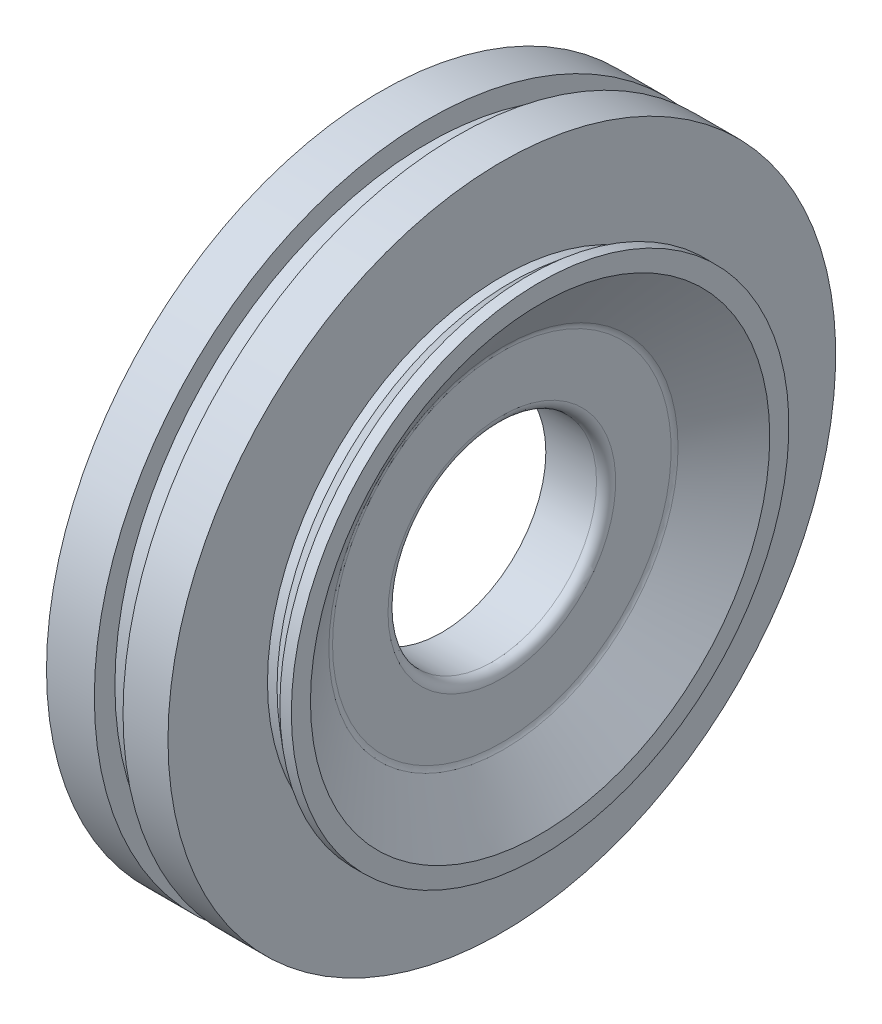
ISO-10303-21;
HEADER;
FILE_DESCRIPTION(('STEP AP214'),'2;1');
FILE_NAME('part.step','',(''),(''),'','','');
FILE_SCHEMA(('AUTOMOTIVE_DESIGN { 1 0 10303 214 1 1 1 1 }'));
ENDSEC;
DATA;
#1=APPLICATION_CONTEXT('core data for automotive mechanical design processes');
#2=APPLICATION_PROTOCOL_DEFINITION('international standard','automotive_design',2000,#1);
#3=PRODUCT_CONTEXT('',#1,'mechanical');
#4=PRODUCT('Part','Part','',(#3));
#5=PRODUCT_RELATED_PRODUCT_CATEGORY('part','',(#4));
#6=PRODUCT_DEFINITION_FORMATION('','',#4);
#7=PRODUCT_DEFINITION_CONTEXT('part definition',#1,'design');
#8=PRODUCT_DEFINITION('design','',#6,#7);
#9=PRODUCT_DEFINITION_SHAPE('','',#8);
#10=(LENGTH_UNIT() NAMED_UNIT(*) SI_UNIT(.MILLI.,.METRE.));
#11=(NAMED_UNIT(*) PLANE_ANGLE_UNIT() SI_UNIT($,.RADIAN.));
#12=(NAMED_UNIT(*) SI_UNIT($,.STERADIAN.) SOLID_ANGLE_UNIT());
#13=UNCERTAINTY_MEASURE_WITH_UNIT(LENGTH_MEASURE(1.E-05),#10,'distance_accuracy_value','');
#14=(GEOMETRIC_REPRESENTATION_CONTEXT(3) GLOBAL_UNCERTAINTY_ASSIGNED_CONTEXT((#13)) GLOBAL_UNIT_ASSIGNED_CONTEXT((#10,
#11,#12)) REPRESENTATION_CONTEXT('',''));
#15=CARTESIAN_POINT('',(0.,0.,0.));
#16=DIRECTION('',(0.,0.,1.));
#17=DIRECTION('',(1.,0.,0.));
#18=AXIS2_PLACEMENT_3D('',#15,#16,#17);
#19=CARTESIAN_POINT('',(0.,0.,0.));
#20=DIRECTION('',(-1.,0.,0.));
#21=DIRECTION('',(0.,0.,1.));
#22=AXIS2_PLACEMENT_3D('',#19,#20,#21);
#23=CYLINDRICAL_SURFACE('',#22,34.9);
#24=CARTESIAN_POINT('',(1.23792887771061,0.,0.));
#25=DIRECTION('',(-1.,0.,0.));
#26=DIRECTION('',(0.,0.,1.));
#27=AXIS2_PLACEMENT_3D('',#24,#25,#26);
#28=CIRCLE('',#27,34.9);
#29=CARTESIAN_POINT('',(1.23792887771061,0.,34.9));
#30=VERTEX_POINT('',#29);
#31=EDGE_CURVE('E49',#30,#30,#28,.T.);
#32=ORIENTED_EDGE('',*,*,#31,.F.);
#33=EDGE_LOOP('',(#32));
#34=FACE_BOUND('',#33,.T.);
#35=CARTESIAN_POINT('',(6.23792887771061,0.,0.));
#36=DIRECTION('',(-1.,0.,0.));
#37=DIRECTION('',(0.,0.,1.));
#38=AXIS2_PLACEMENT_3D('',#35,#36,#37);
#39=CIRCLE('',#38,34.9);
#40=CARTESIAN_POINT('',(6.23792887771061,0.,34.9));
#41=VERTEX_POINT('',#40);
#42=EDGE_CURVE('E112',#41,#41,#39,.T.);
#43=ORIENTED_EDGE('',*,*,#42,.T.);
#44=EDGE_LOOP('',(#43));
#45=FACE_BOUND('',#44,.T.);
#46=ADVANCED_FACE('F29',(#34,#45),#23,.T.);
#47=CARTESIAN_POINT('',(1.23792887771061,27.5660176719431,0.));
#48=DIRECTION('',(1.,0.,0.));
#49=DIRECTION('',(0.,0.,-1.));
#50=AXIS2_PLACEMENT_3D('',#47,#48,#49);
#51=PLANE('',#50);
#52=CARTESIAN_POINT('',(1.23792887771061,0.,0.));
#53=DIRECTION('',(-1.,0.,0.));
#54=DIRECTION('',(0.,0.,1.));
#55=AXIS2_PLACEMENT_3D('',#52,#53,#54);
#56=CIRCLE('',#55,27.5660176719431);
#57=CARTESIAN_POINT('',(1.23792887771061,0.,27.5660176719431));
#58=VERTEX_POINT('',#57);
#59=EDGE_CURVE('E52',#58,#58,#56,.T.);
#60=ORIENTED_EDGE('',*,*,#59,.F.);
#61=EDGE_LOOP('',(#60));
#62=FACE_BOUND('',#61,.T.);
#63=ORIENTED_EDGE('',*,*,#31,.T.);
#64=EDGE_LOOP('',(#63));
#65=FACE_BOUND('',#64,.T.);
#66=ADVANCED_FACE('F183',(#62,#65),#51,.F.);
#67=CARTESIAN_POINT('',(1.73792887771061,0.,0.));
#68=DIRECTION('',(-1.,0.,0.));
#69=DIRECTION('',(0.,0.,1.));
#70=AXIS2_PLACEMENT_3D('',#67,#68,#69);
#71=TOROIDAL_SURFACE('',#70,27.5660176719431,0.5);
#72=CARTESIAN_POINT('',(1.710156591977,0.,0.));
#73=DIRECTION('',(-1.,0.,0.));
#74=DIRECTION('',(0.,0.,1.));
#75=AXIS2_PLACEMENT_3D('',#72,#73,#74);
#76=CIRCLE('',#75,27.0667895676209);
#77=CARTESIAN_POINT('',(1.710156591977,0.,27.0667895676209));
#78=VERTEX_POINT('',#77);
#79=EDGE_CURVE('E55',#78,#78,#76,.T.);
#80=ORIENTED_EDGE('',*,*,#79,.F.);
#81=EDGE_LOOP('',(#80));
#82=FACE_BOUND('',#81,.T.);
#83=ORIENTED_EDGE('',*,*,#59,.T.);
#84=EDGE_LOOP('',(#83));
#85=FACE_BOUND('',#84,.T.);
#86=ADVANCED_FACE('F189',(#82,#85),#71,.T.);
#87=CARTESIAN_POINT('',(1.710156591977,0.,0.));
#88=DIRECTION('',(-1.,0.,0.));
#89=DIRECTION('',(0.,0.,1.));
#90=AXIS2_PLACEMENT_3D('',#87,#88,#89);
#91=CONICAL_SURFACE('',#90,27.0667895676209,0.055573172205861);
#92=CARTESIAN_POINT('',(8.20913066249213,0.,0.));
#93=DIRECTION('',(-1.,0.,0.));
#94=DIRECTION('',(0.,0.,1.));
#95=AXIS2_PLACEMENT_3D('',#92,#93,#94);
#96=CIRCLE('',#95,26.7052486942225);
#97=CARTESIAN_POINT('',(8.20913066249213,0.,26.7052486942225));
#98=VERTEX_POINT('',#97);
#99=EDGE_CURVE('E58',#98,#98,#96,.T.);
#100=ORIENTED_EDGE('',*,*,#99,.F.);
#101=EDGE_LOOP('',(#100));
#102=FACE_BOUND('',#101,.T.);
#103=ORIENTED_EDGE('',*,*,#79,.T.);
#104=EDGE_LOOP('',(#103));
#105=FACE_BOUND('',#104,.T.);
#106=ADVANCED_FACE('F363',(#102,#105),#91,.F.);
#107=CARTESIAN_POINT('',(8.09804151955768,0.,0.));
#108=DIRECTION('',(-1.,0.,0.));
#109=DIRECTION('',(0.,0.,1.));
#110=AXIS2_PLACEMENT_3D('',#107,#108,#109);
#111=TOROIDAL_SURFACE('',#110,24.7083362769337,2.);
#112=CARTESIAN_POINT('',(10.0959925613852,0.,0.));
#113=DIRECTION('',(-1.,0.,0.));
#114=DIRECTION('',(0.,0.,1.));
#115=AXIS2_PLACEMENT_3D('',#112,#113,#114);
#116=CIRCLE('',#115,24.6178286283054);
#117=CARTESIAN_POINT('',(10.0959925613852,0.,24.6178286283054));
#118=VERTEX_POINT('',#117);
#119=EDGE_CURVE('E61',#118,#118,#116,.T.);
#120=ORIENTED_EDGE('',*,*,#119,.F.);
#121=EDGE_LOOP('',(#120));
#122=FACE_BOUND('',#121,.T.);
#123=ORIENTED_EDGE('',*,*,#99,.T.);
#124=EDGE_LOOP('',(#123));
#125=FACE_BOUND('',#124,.T.);
#126=ADVANCED_FACE('F353',(#122,#125),#111,.F.);
#127=CARTESIAN_POINT('',(10.0959925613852,0.,0.));
#128=DIRECTION('',(1.,0.,0.));
#129=DIRECTION('',(0.,0.,-1.));
#130=AXIS2_PLACEMENT_3D('',#127,#128,#129);
#131=CONICAL_SURFACE('',#130,24.6178286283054,1.52552704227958);
#132=CARTESIAN_POINT('',(9.79418985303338,0.,0.));
#133=DIRECTION('',(-1.,0.,0.));
#134=DIRECTION('',(0.,0.,1.));
#135=AXIS2_PLACEMENT_3D('',#132,#133,#134);
#136=CIRCLE('',#135,17.9555515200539);
#137=CARTESIAN_POINT('',(9.79418985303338,0.,17.9555515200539));
#138=VERTEX_POINT('',#137);
#139=EDGE_CURVE('E64',#138,#138,#136,.T.);
#140=ORIENTED_EDGE('',*,*,#139,.F.);
#141=EDGE_LOOP('',(#140));
#142=FACE_BOUND('',#141,.T.);
#143=ORIENTED_EDGE('',*,*,#119,.T.);
#144=EDGE_LOOP('',(#143));
#145=FACE_BOUND('',#144,.T.);
#146=ADVANCED_FACE('F343',(#142,#145),#131,.T.);
#147=CARTESIAN_POINT('',(9.29470209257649,0.,0.));
#148=DIRECTION('',(-1.,0.,0.));
#149=DIRECTION('',(0.,0.,1.));
#150=AXIS2_PLACEMENT_3D('',#147,#148,#149);
#151=TOROIDAL_SURFACE('',#150,17.9781784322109,0.500000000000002);
#152=CARTESIAN_POINT('',(9.3677140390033,0.,0.));
#153=DIRECTION('',(-1.,0.,0.));
#154=DIRECTION('',(0.,0.,1.));
#155=AXIS2_PLACEMENT_3D('',#152,#153,#154);
#156=CIRCLE('',#155,17.4835379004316);
#157=CARTESIAN_POINT('',(9.3677140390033,0.,17.4835379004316));
#158=VERTEX_POINT('',#157);
#159=EDGE_CURVE('E67',#158,#158,#156,.T.);
#160=ORIENTED_EDGE('',*,*,#159,.F.);
#161=EDGE_LOOP('',(#160));
#162=FACE_BOUND('',#161,.T.);
#163=ORIENTED_EDGE('',*,*,#139,.T.);
#164=EDGE_LOOP('',(#163));
#165=FACE_BOUND('',#164,.T.);
#166=ADVANCED_FACE('F333',(#162,#165),#151,.F.);
#167=CARTESIAN_POINT('',(9.3677140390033,0.,0.));
#168=DIRECTION('',(1.,0.,0.));
#169=DIRECTION('',(0.,0.,-1.));
#170=AXIS2_PLACEMENT_3D('',#167,#168,#169);
#171=CONICAL_SURFACE('',#170,17.4835379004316,0.146547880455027);
#172=CARTESIAN_POINT('',(7.2649169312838,0.,0.));
#173=DIRECTION('',(-1.,0.,0.));
#174=DIRECTION('',(0.,0.,1.));
#175=AXIS2_PLACEMENT_3D('',#172,#173,#174);
#176=CIRCLE('',#175,17.1731522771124);
#177=CARTESIAN_POINT('',(7.2649169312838,0.,17.1731522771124));
#178=VERTEX_POINT('',#177);
#179=EDGE_CURVE('E70',#178,#178,#176,.T.);
#180=ORIENTED_EDGE('',*,*,#179,.F.);
#181=EDGE_LOOP('',(#180));
#182=FACE_BOUND('',#181,.T.);
#183=ORIENTED_EDGE('',*,*,#159,.T.);
#184=EDGE_LOOP('',(#183));
#185=FACE_BOUND('',#184,.T.);
#186=ADVANCED_FACE('F323',(#182,#185),#171,.T.);
#187=CARTESIAN_POINT('',(7.33792887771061,0.,0.));
#188=DIRECTION('',(-1.,0.,0.));
#189=DIRECTION('',(0.,0.,1.));
#190=AXIS2_PLACEMENT_3D('',#187,#188,#189);
#191=TOROIDAL_SURFACE('',#190,16.678511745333,0.5);
#192=CARTESIAN_POINT('',(6.83792887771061,0.,0.));
#193=DIRECTION('',(-1.,0.,0.));
#194=DIRECTION('',(0.,0.,1.));
#195=AXIS2_PLACEMENT_3D('',#192,#193,#194);
#196=CIRCLE('',#195,16.678511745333);
#197=CARTESIAN_POINT('',(6.83792887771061,0.,16.678511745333));
#198=VERTEX_POINT('',#197);
#199=EDGE_CURVE('E73',#198,#198,#196,.T.);
#200=ORIENTED_EDGE('',*,*,#199,.F.);
#201=EDGE_LOOP('',(#200));
#202=FACE_BOUND('',#201,.T.);
#203=ORIENTED_EDGE('',*,*,#179,.T.);
#204=EDGE_LOOP('',(#203));
#205=FACE_BOUND('',#204,.T.);
#206=ADVANCED_FACE('F313',(#202,#205),#191,.T.);
#207=CARTESIAN_POINT('',(6.83792887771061,16.678511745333,0.));
#208=DIRECTION('',(1.,0.,0.));
#209=DIRECTION('',(0.,0.,-1.));
#210=AXIS2_PLACEMENT_3D('',#207,#208,#209);
#211=PLANE('',#210);
#212=CARTESIAN_POINT('',(6.83792887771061,0.,0.));
#213=DIRECTION('',(-1.,0.,0.));
#214=DIRECTION('',(0.,0.,1.));
#215=AXIS2_PLACEMENT_3D('',#212,#213,#214);
#216=CIRCLE('',#215,14.5);
#217=CARTESIAN_POINT('',(6.83792887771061,0.,14.5));
#218=VERTEX_POINT('',#217);
#219=EDGE_CURVE('E76',#218,#218,#216,.T.);
#220=ORIENTED_EDGE('',*,*,#219,.F.);
#221=EDGE_LOOP('',(#220));
#222=FACE_BOUND('',#221,.T.);
#223=ORIENTED_EDGE('',*,*,#199,.T.);
#224=EDGE_LOOP('',(#223));
#225=FACE_BOUND('',#224,.T.);
#226=ADVANCED_FACE('F303',(#222,#225),#211,.F.);
#227=CARTESIAN_POINT('',(0.,0.,0.));
#228=DIRECTION('',(-1.,0.,0.));
#229=DIRECTION('',(0.,0.,1.));
#230=AXIS2_PLACEMENT_3D('',#227,#228,#229);
#231=CYLINDRICAL_SURFACE('',#230,14.5);
#232=CARTESIAN_POINT('',(7.63792887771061,0.,0.));
#233=DIRECTION('',(-1.,0.,0.));
#234=DIRECTION('',(0.,0.,1.));
#235=AXIS2_PLACEMENT_3D('',#232,#233,#234);
#236=CIRCLE('',#235,14.5);
#237=CARTESIAN_POINT('',(7.63792887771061,0.,14.5));
#238=VERTEX_POINT('',#237);
#239=EDGE_CURVE('E79',#238,#238,#236,.T.);
#240=ORIENTED_EDGE('',*,*,#239,.F.);
#241=EDGE_LOOP('',(#240));
#242=FACE_BOUND('',#241,.T.);
#243=ORIENTED_EDGE('',*,*,#219,.T.);
#244=EDGE_LOOP('',(#243));
#245=FACE_BOUND('',#244,.T.);
#246=ADVANCED_FACE('F293',(#242,#245),#231,.F.);
#247=CARTESIAN_POINT('',(7.63792887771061,14.5,0.));
#248=DIRECTION('',(1.,0.,0.));
#249=DIRECTION('',(0.,0.,-1.));
#250=AXIS2_PLACEMENT_3D('',#247,#248,#249);
#251=PLANE('',#250);
#252=CARTESIAN_POINT('',(7.63792887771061,0.,0.));
#253=DIRECTION('',(-1.,0.,0.));
#254=DIRECTION('',(0.,0.,1.));
#255=AXIS2_PLACEMENT_3D('',#252,#253,#254);
#256=CIRCLE('',#255,10.9);
#257=CARTESIAN_POINT('',(7.63792887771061,0.,10.9));
#258=VERTEX_POINT('',#257);
#259=EDGE_CURVE('E82',#258,#258,#256,.T.);
#260=ORIENTED_EDGE('',*,*,#259,.F.);
#261=EDGE_LOOP('',(#260));
#262=FACE_BOUND('',#261,.T.);
#263=ORIENTED_EDGE('',*,*,#239,.T.);
#264=EDGE_LOOP('',(#263));
#265=FACE_BOUND('',#264,.T.);
#266=ADVANCED_FACE('F232',(#262,#265),#251,.F.);
#267=CARTESIAN_POINT('',(0.,0.,0.));
#268=DIRECTION('',(-1.,0.,0.));
#269=DIRECTION('',(0.,0.,1.));
#270=AXIS2_PLACEMENT_3D('',#267,#268,#269);
#271=CYLINDRICAL_SURFACE('',#270,10.9);
#272=CARTESIAN_POINT('',(12.9379288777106,0.,0.));
#273=DIRECTION('',(-1.,0.,0.));
#274=DIRECTION('',(0.,0.,1.));
#275=AXIS2_PLACEMENT_3D('',#272,#273,#274);
#276=CIRCLE('',#275,10.9);
#277=CARTESIAN_POINT('',(12.9379288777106,0.,10.9));
#278=VERTEX_POINT('',#277);
#279=EDGE_CURVE('E36',#278,#278,#276,.F.);
#280=ORIENTED_EDGE('',*,*,#279,.T.);
#281=EDGE_LOOP('',(#280));
#282=FACE_BOUND('',#281,.T.);
#283=ORIENTED_EDGE('',*,*,#259,.T.);
#284=EDGE_LOOP('',(#283));
#285=FACE_BOUND('',#284,.T.);
#286=ADVANCED_FACE('F179',(#282,#285),#271,.F.);
#287=CARTESIAN_POINT('',(13.9379288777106,10.9,0.));
#288=DIRECTION('',(-1.,0.,0.));
#289=DIRECTION('',(0.,0.,1.));
#290=AXIS2_PLACEMENT_3D('',#287,#288,#289);
#291=PLANE('',#290);
#292=CARTESIAN_POINT('',(13.9379288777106,0.,0.));
#293=DIRECTION('',(-1.,0.,0.));
#294=DIRECTION('',(0.,0.,1.));
#295=AXIS2_PLACEMENT_3D('',#292,#293,#294);
#296=CIRCLE('',#295,11.9);
#297=CARTESIAN_POINT('',(13.9379288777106,0.,11.9));
#298=VERTEX_POINT('',#297);
#299=EDGE_CURVE('E40',#298,#298,#296,.T.);
#300=ORIENTED_EDGE('',*,*,#299,.T.);
#301=EDGE_LOOP('',(#300));
#302=FACE_BOUND('',#301,.T.);
#303=CARTESIAN_POINT('',(13.9379288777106,0.,0.));
#304=DIRECTION('',(-1.,0.,0.));
#305=DIRECTION('',(0.,0.,1.));
#306=AXIS2_PLACEMENT_3D('',#303,#304,#305);
#307=CIRCLE('',#306,17.6974936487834);
#308=CARTESIAN_POINT('',(13.9379288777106,0.,17.6974936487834));
#309=VERTEX_POINT('',#308);
#310=EDGE_CURVE('E44',#309,#309,#307,.F.);
#311=ORIENTED_EDGE('',*,*,#310,.T.);
#312=EDGE_LOOP('',(#311));
#313=FACE_BOUND('',#312,.T.);
#314=ADVANCED_FACE('F174',(#302,#313),#291,.F.);
#315=CARTESIAN_POINT('',(13.9379288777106,0.,0.));
#316=DIRECTION('',(1.,0.,0.));
#317=DIRECTION('',(0.,0.,-1.));
#318=AXIS2_PLACEMENT_3D('',#315,#316,#317);
#319=CONICAL_SURFACE('',#318,18.,0.983287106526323);
#320=CARTESIAN_POINT('',(14.105605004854,0.,0.));
#321=DIRECTION('',(1.,0.,0.));
#322=DIRECTION('',(0.,0.,-1.));
#323=AXIS2_PLACEMENT_3D('',#320,#321,#322);
#324=CIRCLE('',#323,18.2517832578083);
#325=CARTESIAN_POINT('',(14.105605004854,0.,-18.2517832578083));
#326=VERTEX_POINT('',#325);
#327=EDGE_CURVE('E10',#326,#326,#324,.F.);
#328=ORIENTED_EDGE('',*,*,#327,.T.);
#329=EDGE_LOOP('',(#328));
#330=FACE_BOUND('',#329,.T.);
#331=CARTESIAN_POINT('',(17.9379288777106,0.,0.));
#332=DIRECTION('',(-1.,0.,0.));
#333=DIRECTION('',(0.,0.,1.));
#334=AXIS2_PLACEMENT_3D('',#331,#332,#333);
#335=CIRCLE('',#334,24.0064187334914);
#336=CARTESIAN_POINT('',(17.9379288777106,0.,24.0064187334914));
#337=VERTEX_POINT('',#336);
#338=EDGE_CURVE('E85',#337,#337,#335,.T.);
#339=ORIENTED_EDGE('',*,*,#338,.F.);
#340=EDGE_LOOP('',(#339));
#341=FACE_BOUND('',#340,.T.);
#342=ADVANCED_FACE('F169',(#330,#341),#319,.F.);
#343=CARTESIAN_POINT('',(17.9379288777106,26.0064187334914,0.));
#344=DIRECTION('',(-1.,0.,0.));
#345=DIRECTION('',(0.,0.,1.));
#346=AXIS2_PLACEMENT_3D('',#343,#344,#345);
#347=PLANE('',#346);
#348=CARTESIAN_POINT('',(17.9379288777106,0.,0.));
#349=DIRECTION('',(-1.,0.,0.));
#350=DIRECTION('',(0.,0.,1.));
#351=AXIS2_PLACEMENT_3D('',#348,#349,#350);
#352=CIRCLE('',#351,26.0064187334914);
#353=CARTESIAN_POINT('',(17.9379288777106,0.,26.0064187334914));
#354=VERTEX_POINT('',#353);
#355=EDGE_CURVE('E88',#354,#354,#352,.T.);
#356=ORIENTED_EDGE('',*,*,#355,.F.);
#357=EDGE_LOOP('',(#356));
#358=FACE_BOUND('',#357,.T.);
#359=ORIENTED_EDGE('',*,*,#338,.T.);
#360=EDGE_LOOP('',(#359));
#361=FACE_BOUND('',#360,.T.);
#362=ADVANCED_FACE('F163',(#358,#361),#347,.F.);
#363=CARTESIAN_POINT('',(0.,0.,0.));
#364=DIRECTION('',(-1.,0.,0.));
#365=DIRECTION('',(0.,0.,1.));
#366=AXIS2_PLACEMENT_3D('',#363,#364,#365);
#367=CYLINDRICAL_SURFACE('',#366,26.0064187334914);
#368=CARTESIAN_POINT('',(16.7379288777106,0.,0.));
#369=DIRECTION('',(-1.,0.,0.));
#370=DIRECTION('',(0.,0.,1.));
#371=AXIS2_PLACEMENT_3D('',#368,#369,#370);
#372=CIRCLE('',#371,26.0064187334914);
#373=CARTESIAN_POINT('',(16.7379288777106,0.,26.0064187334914));
#374=VERTEX_POINT('',#373);
#375=EDGE_CURVE('E91',#374,#374,#372,.T.);
#376=ORIENTED_EDGE('',*,*,#375,.F.);
#377=EDGE_LOOP('',(#376));
#378=FACE_BOUND('',#377,.T.);
#379=ORIENTED_EDGE('',*,*,#355,.T.);
#380=EDGE_LOOP('',(#379));
#381=FACE_BOUND('',#380,.T.);
#382=ADVANCED_FACE('F157',(#378,#381),#367,.T.);
#383=CARTESIAN_POINT('',(16.7379288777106,0.,0.));
#384=DIRECTION('',(1.,0.,0.));
#385=DIRECTION('',(0.,0.,-1.));
#386=AXIS2_PLACEMENT_3D('',#383,#384,#385);
#387=CONICAL_SURFACE('',#386,26.0064187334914,0.696839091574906);
#388=CARTESIAN_POINT('',(14.9379288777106,0.,0.));
#389=DIRECTION('',(-1.,0.,0.));
#390=DIRECTION('',(0.,0.,1.));
#391=AXIS2_PLACEMENT_3D('',#388,#389,#390);
#392=CIRCLE('',#391,24.5);
#393=CARTESIAN_POINT('',(14.9379288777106,0.,24.5));
#394=VERTEX_POINT('',#393);
#395=EDGE_CURVE('E94',#394,#394,#392,.T.);
#396=ORIENTED_EDGE('',*,*,#395,.F.);
#397=EDGE_LOOP('',(#396));
#398=FACE_BOUND('',#397,.T.);
#399=ORIENTED_EDGE('',*,*,#375,.T.);
#400=EDGE_LOOP('',(#399));
#401=FACE_BOUND('',#400,.T.);
#402=ADVANCED_FACE('F151',(#398,#401),#387,.T.);
#403=CARTESIAN_POINT('',(0.,0.,0.));
#404=DIRECTION('',(-1.,0.,0.));
#405=DIRECTION('',(0.,0.,1.));
#406=AXIS2_PLACEMENT_3D('',#403,#404,#405);
#407=CYLINDRICAL_SURFACE('',#406,24.5);
#408=CARTESIAN_POINT('',(13.9379288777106,0.,0.));
#409=DIRECTION('',(-1.,0.,0.));
#410=DIRECTION('',(0.,0.,1.));
#411=AXIS2_PLACEMENT_3D('',#408,#409,#410);
#412=CIRCLE('',#411,24.5);
#413=CARTESIAN_POINT('',(13.9379288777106,0.,24.5));
#414=VERTEX_POINT('',#413);
#415=EDGE_CURVE('E97',#414,#414,#412,.T.);
#416=ORIENTED_EDGE('',*,*,#415,.F.);
#417=EDGE_LOOP('',(#416));
#418=FACE_BOUND('',#417,.T.);
#419=ORIENTED_EDGE('',*,*,#395,.T.);
#420=EDGE_LOOP('',(#419));
#421=FACE_BOUND('',#420,.T.);
#422=ADVANCED_FACE('F145',(#418,#421),#407,.T.);
#423=CARTESIAN_POINT('',(13.9379288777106,34.9,0.));
#424=DIRECTION('',(-1.,0.,0.));
#425=DIRECTION('',(0.,0.,1.));
#426=AXIS2_PLACEMENT_3D('',#423,#424,#425);
#427=PLANE('',#426);
#428=CARTESIAN_POINT('',(13.9379288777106,0.,0.));
#429=DIRECTION('',(-1.,0.,0.));
#430=DIRECTION('',(0.,0.,1.));
#431=AXIS2_PLACEMENT_3D('',#428,#429,#430);
#432=CIRCLE('',#431,34.9);
#433=CARTESIAN_POINT('',(13.9379288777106,0.,34.9));
#434=VERTEX_POINT('',#433);
#435=EDGE_CURVE('E100',#434,#434,#432,.T.);
#436=ORIENTED_EDGE('',*,*,#435,.F.);
#437=EDGE_LOOP('',(#436));
#438=FACE_BOUND('',#437,.T.);
#439=ORIENTED_EDGE('',*,*,#415,.T.);
#440=EDGE_LOOP('',(#439));
#441=FACE_BOUND('',#440,.T.);
#442=ADVANCED_FACE('F139',(#438,#441),#427,.F.);
#443=CARTESIAN_POINT('',(0.,0.,0.));
#444=DIRECTION('',(-1.,0.,0.));
#445=DIRECTION('',(0.,0.,1.));
#446=AXIS2_PLACEMENT_3D('',#443,#444,#445);
#447=CYLINDRICAL_SURFACE('',#446,34.9);
#448=CARTESIAN_POINT('',(9.23792887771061,0.,0.));
#449=DIRECTION('',(-1.,0.,0.));
#450=DIRECTION('',(0.,0.,1.));
#451=AXIS2_PLACEMENT_3D('',#448,#449,#450);
#452=CIRCLE('',#451,34.9);
#453=CARTESIAN_POINT('',(9.23792887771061,0.,34.9));
#454=VERTEX_POINT('',#453);
#455=EDGE_CURVE('E103',#454,#454,#452,.T.);
#456=ORIENTED_EDGE('',*,*,#455,.F.);
#457=EDGE_LOOP('',(#456));
#458=FACE_BOUND('',#457,.T.);
#459=ORIENTED_EDGE('',*,*,#435,.T.);
#460=EDGE_LOOP('',(#459));
#461=FACE_BOUND('',#460,.T.);
#462=ADVANCED_FACE('F133',(#458,#461),#447,.T.);
#463=CARTESIAN_POINT('',(9.23792887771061,32.75,0.));
#464=DIRECTION('',(1.,0.,0.));
#465=DIRECTION('',(0.,0.,-1.));
#466=AXIS2_PLACEMENT_3D('',#463,#464,#465);
#467=PLANE('',#466);
#468=CARTESIAN_POINT('',(9.23792887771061,0.,0.));
#469=DIRECTION('',(-1.,0.,0.));
#470=DIRECTION('',(0.,0.,1.));
#471=AXIS2_PLACEMENT_3D('',#468,#469,#470);
#472=CIRCLE('',#471,32.75);
#473=CARTESIAN_POINT('',(9.23792887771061,0.,32.75));
#474=VERTEX_POINT('',#473);
#475=EDGE_CURVE('E106',#474,#474,#472,.T.);
#476=ORIENTED_EDGE('',*,*,#475,.F.);
#477=EDGE_LOOP('',(#476));
#478=FACE_BOUND('',#477,.T.);
#479=ORIENTED_EDGE('',*,*,#455,.T.);
#480=EDGE_LOOP('',(#479));
#481=FACE_BOUND('',#480,.T.);
#482=ADVANCED_FACE('F127',(#478,#481),#467,.F.);
#483=CARTESIAN_POINT('',(0.,0.,0.));
#484=DIRECTION('',(-1.,0.,0.));
#485=DIRECTION('',(0.,0.,1.));
#486=AXIS2_PLACEMENT_3D('',#483,#484,#485);
#487=CYLINDRICAL_SURFACE('',#486,32.75);
#488=CARTESIAN_POINT('',(6.23792887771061,0.,0.));
#489=DIRECTION('',(-1.,0.,0.));
#490=DIRECTION('',(0.,0.,1.));
#491=AXIS2_PLACEMENT_3D('',#488,#489,#490);
#492=CIRCLE('',#491,32.75);
#493=CARTESIAN_POINT('',(6.23792887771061,0.,32.75));
#494=VERTEX_POINT('',#493);
#495=EDGE_CURVE('E109',#494,#494,#492,.T.);
#496=ORIENTED_EDGE('',*,*,#495,.F.);
#497=EDGE_LOOP('',(#496));
#498=FACE_BOUND('',#497,.T.);
#499=ORIENTED_EDGE('',*,*,#475,.T.);
#500=EDGE_LOOP('',(#499));
#501=FACE_BOUND('',#500,.T.);
#502=ADVANCED_FACE('F121',(#498,#501),#487,.T.);
#503=CARTESIAN_POINT('',(6.23792887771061,34.9,0.));
#504=DIRECTION('',(-1.,0.,0.));
#505=DIRECTION('',(0.,0.,1.));
#506=AXIS2_PLACEMENT_3D('',#503,#504,#505);
#507=PLANE('',#506);
#508=ORIENTED_EDGE('',*,*,#42,.F.);
#509=EDGE_LOOP('',(#508));
#510=FACE_BOUND('',#509,.T.);
#511=ORIENTED_EDGE('',*,*,#495,.T.);
#512=EDGE_LOOP('',(#511));
#513=FACE_BOUND('',#512,.T.);
#514=ADVANCED_FACE('F117',(#510,#513),#507,.F.);
#515=CARTESIAN_POINT('',(12.9379288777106,0.,0.));
#516=DIRECTION('',(-1.,0.,0.));
#517=DIRECTION('',(0.,0.,1.));
#518=AXIS2_PLACEMENT_3D('',#515,#516,#517);
#519=TOROIDAL_SURFACE('',#518,11.9,1.);
#520=ORIENTED_EDGE('',*,*,#279,.F.);
#521=EDGE_LOOP('',(#520));
#522=FACE_BOUND('',#521,.T.);
#523=ORIENTED_EDGE('',*,*,#299,.F.);
#524=EDGE_LOOP('',(#523));
#525=FACE_BOUND('',#524,.T.);
#526=ADVANCED_FACE('F120',(#522,#525),#519,.T.);
#527=CARTESIAN_POINT('',(14.9379288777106,0.,0.));
#528=DIRECTION('',(-1.,0.,0.));
#529=DIRECTION('',(0.,0.,1.));
#530=AXIS2_PLACEMENT_3D('',#527,#528,#529);
#531=TOROIDAL_SURFACE('',#530,17.6974936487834,1.);
#532=ORIENTED_EDGE('',*,*,#310,.F.);
#533=EDGE_LOOP('',(#532));
#534=FACE_BOUND('',#533,.T.);
#535=ORIENTED_EDGE('',*,*,#327,.F.);
#536=EDGE_LOOP('',(#535));
#537=FACE_BOUND('',#536,.T.);
#538=ADVANCED_FACE('F31',(#534,#537),#531,.F.);
#539=CLOSED_SHELL('',(#46,#66,#86,#106,#126,#146,#166,#186,#206,#226,#246,#266,#286,#314,#342,
#362,#382,#402,#422,#442,#462,#482,#502,#514,#526,#538));
#540=MANIFOLD_SOLID_BREP('B2',#539);
#541=ADVANCED_BREP_SHAPE_REPRESENTATION('',(#18,#540),#14);
#542=SHAPE_DEFINITION_REPRESENTATION(#9,#541);
ENDSEC;
END-ISO-10303-21;
